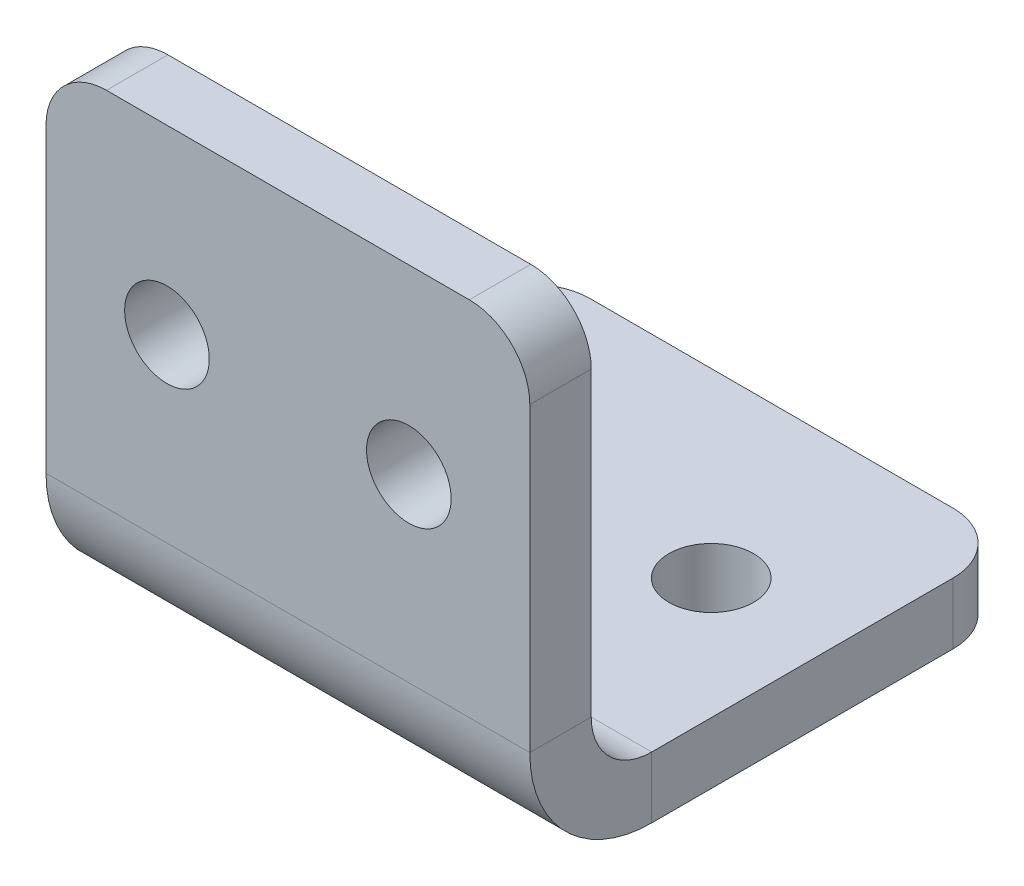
ISO-10303-21;
HEADER;
FILE_DESCRIPTION(('STEP AP214'),'2;1');
FILE_NAME('part.step','',(''),(''),'','','');
FILE_SCHEMA(('AUTOMOTIVE_DESIGN { 1 0 10303 214 1 1 1 1 }'));
ENDSEC;
DATA;
#1=APPLICATION_CONTEXT('core data for automotive mechanical design processes');
#2=APPLICATION_PROTOCOL_DEFINITION('international standard','automotive_design',2000,#1);
#3=PRODUCT_CONTEXT('',#1,'mechanical');
#4=PRODUCT('Part','Part','',(#3));
#5=PRODUCT_RELATED_PRODUCT_CATEGORY('part','',(#4));
#6=PRODUCT_DEFINITION_FORMATION('','',#4);
#7=PRODUCT_DEFINITION_CONTEXT('part definition',#1,'design');
#8=PRODUCT_DEFINITION('design','',#6,#7);
#9=PRODUCT_DEFINITION_SHAPE('','',#8);
#10=(LENGTH_UNIT() NAMED_UNIT(*) SI_UNIT(.MILLI.,.METRE.));
#11=(NAMED_UNIT(*) PLANE_ANGLE_UNIT() SI_UNIT($,.RADIAN.));
#12=(NAMED_UNIT(*) SI_UNIT($,.STERADIAN.) SOLID_ANGLE_UNIT());
#13=UNCERTAINTY_MEASURE_WITH_UNIT(LENGTH_MEASURE(1.E-05),#10,'distance_accuracy_value','');
#14=(GEOMETRIC_REPRESENTATION_CONTEXT(3) GLOBAL_UNCERTAINTY_ASSIGNED_CONTEXT((#13)) GLOBAL_UNIT_ASSIGNED_CONTEXT((#10,
#11,#12)) REPRESENTATION_CONTEXT('',''));
#15=CARTESIAN_POINT('',(0.,0.,0.));
#16=DIRECTION('',(0.,0.,1.));
#17=DIRECTION('',(1.,0.,0.));
#18=AXIS2_PLACEMENT_3D('',#15,#16,#17);
#19=CARTESIAN_POINT('',(40.,0.,0.));
#20=DIRECTION('',(0.,-1.,0.));
#21=DIRECTION('',(0.,0.,-1.));
#22=AXIS2_PLACEMENT_3D('',#19,#20,#21);
#23=PLANE('',#22);
#24=CARTESIAN_POINT('',(10.,0.,-25.00000001));
#25=DIRECTION('',(0.,-1.,0.));
#26=DIRECTION('',(-1.,0.,0.));
#27=AXIS2_PLACEMENT_3D('',#24,#25,#26);
#28=CIRCLE('',#27,3.5);
#29=CARTESIAN_POINT('',(6.5,0.,-25.00000001));
#30=VERTEX_POINT('',#29);
#31=EDGE_CURVE('E330',#30,#30,#28,.F.);
#32=ORIENTED_EDGE('',*,*,#31,.F.);
#33=EDGE_LOOP('',(#32));
#34=FACE_BOUND('',#33,.T.);
#35=DIRECTION('',(0.,0.,1.));
#36=VECTOR('',#35,1.);
#37=CARTESIAN_POINT('',(40.,0.,0.));
#38=LINE('',#37,#36);
#39=CARTESIAN_POINT('',(40.,0.,-35.00000001));
#40=VERTEX_POINT('',#39);
#41=CARTESIAN_POINT('',(40.,0.,-10.08));
#42=VERTEX_POINT('',#41);
#43=EDGE_CURVE('E226',#40,#42,#38,.T.);
#44=ORIENTED_EDGE('',*,*,#43,.F.);
#45=CARTESIAN_POINT('',(35.,0.,-35.00000001));
#46=DIRECTION('',(0.,-1.,0.));
#47=DIRECTION('',(0.,0.,-1.));
#48=AXIS2_PLACEMENT_3D('',#45,#46,#47);
#49=CIRCLE('',#48,5.);
#50=CARTESIAN_POINT('',(35.,0.,-40.00000001));
#51=VERTEX_POINT('',#50);
#52=EDGE_CURVE('E266',#40,#51,#49,.F.);
#53=ORIENTED_EDGE('',*,*,#52,.T.);
#54=DIRECTION('',(-1.,0.,0.));
#55=VECTOR('',#54,1.);
#56=CARTESIAN_POINT('',(40.,0.,-40.00000001));
#57=LINE('',#56,#55);
#58=CARTESIAN_POINT('',(5.,0.,-40.00000001));
#59=VERTEX_POINT('',#58);
#60=EDGE_CURVE('E229',#51,#59,#57,.T.);
#61=ORIENTED_EDGE('',*,*,#60,.T.);
#62=CARTESIAN_POINT('',(5.,0.,-35.00000001));
#63=DIRECTION('',(0.,-1.,0.));
#64=DIRECTION('',(0.,0.,-1.));
#65=AXIS2_PLACEMENT_3D('',#62,#63,#64);
#66=CIRCLE('',#65,5.);
#67=CARTESIAN_POINT('',(0.,0.,-35.00000001));
#68=VERTEX_POINT('',#67);
#69=EDGE_CURVE('E264',#59,#68,#66,.F.);
#70=ORIENTED_EDGE('',*,*,#69,.T.);
#71=DIRECTION('',(0.,0.,1.));
#72=VECTOR('',#71,1.);
#73=CARTESIAN_POINT('',(0.,0.,0.));
#74=LINE('',#73,#72);
#75=CARTESIAN_POINT('',(0.,0.,-10.08));
#76=VERTEX_POINT('',#75);
#77=EDGE_CURVE('E224',#68,#76,#74,.T.);
#78=ORIENTED_EDGE('',*,*,#77,.T.);
#79=DIRECTION('',(1.,0.,0.));
#80=VECTOR('',#79,1.);
#81=CARTESIAN_POINT('',(40.,0.,-10.08));
#82=LINE('',#81,#80);
#83=EDGE_CURVE('E215',#42,#76,#82,.F.);
#84=ORIENTED_EDGE('',*,*,#83,.F.);
#85=EDGE_LOOP('',(#44,#53,#61,#70,#78,#84));
#86=FACE_BOUND('',#85,.T.);
#87=CARTESIAN_POINT('',(30.,0.,-25.00000001));
#88=DIRECTION('',(0.,-1.,0.));
#89=DIRECTION('',(-1.,0.,0.));
#90=AXIS2_PLACEMENT_3D('',#87,#88,#89);
#91=CIRCLE('',#90,3.5);
#92=CARTESIAN_POINT('',(26.5,0.,-25.00000001));
#93=VERTEX_POINT('',#92);
#94=EDGE_CURVE('E241',#93,#93,#91,.T.);
#95=ORIENTED_EDGE('',*,*,#94,.T.);
#96=EDGE_LOOP('',(#95));
#97=FACE_BOUND('',#96,.T.);
#98=ADVANCED_FACE('F63',(#34,#86,#97),#23,.F.);
#99=CARTESIAN_POINT('',(40.,-5.08,0.));
#100=DIRECTION('',(0.,-1.,0.));
#101=DIRECTION('',(0.,0.,-1.));
#102=AXIS2_PLACEMENT_3D('',#99,#100,#101);
#103=PLANE('',#102);
#104=DIRECTION('',(1.,0.,0.));
#105=VECTOR('',#104,1.);
#106=CARTESIAN_POINT('',(40.,-5.08,-40.00000001));
#107=LINE('',#106,#105);
#108=CARTESIAN_POINT('',(35.,-5.08,-40.00000001));
#109=VERTEX_POINT('',#108);
#110=CARTESIAN_POINT('',(5.,-5.08,-40.00000001));
#111=VERTEX_POINT('',#110);
#112=EDGE_CURVE('E227',#109,#111,#107,.F.);
#113=ORIENTED_EDGE('',*,*,#112,.F.);
#114=CARTESIAN_POINT('',(35.,-5.08,-35.00000001));
#115=DIRECTION('',(0.,-1.,0.));
#116=DIRECTION('',(0.,0.,-1.));
#117=AXIS2_PLACEMENT_3D('',#114,#115,#116);
#118=CIRCLE('',#117,5.);
#119=CARTESIAN_POINT('',(40.,-5.08,-35.00000001));
#120=VERTEX_POINT('',#119);
#121=EDGE_CURVE('E71',#109,#120,#118,.T.);
#122=ORIENTED_EDGE('',*,*,#121,.T.);
#123=DIRECTION('',(0.,0.,-1.));
#124=VECTOR('',#123,1.);
#125=CARTESIAN_POINT('',(40.,-5.08,0.));
#126=LINE('',#125,#124);
#127=CARTESIAN_POINT('',(40.,-5.08000000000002,-10.08));
#128=VERTEX_POINT('',#127);
#129=EDGE_CURVE('E234',#120,#128,#126,.F.);
#130=ORIENTED_EDGE('',*,*,#129,.T.);
#131=DIRECTION('',(1.,0.,0.));
#132=VECTOR('',#131,1.);
#133=CARTESIAN_POINT('',(40.,-5.08000000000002,-10.08));
#134=LINE('',#133,#132);
#135=CARTESIAN_POINT('',(0.,-5.08,-10.08));
#136=VERTEX_POINT('',#135);
#137=EDGE_CURVE('E161',#128,#136,#134,.F.);
#138=ORIENTED_EDGE('',*,*,#137,.T.);
#139=DIRECTION('',(0.,0.,-1.));
#140=VECTOR('',#139,1.);
#141=CARTESIAN_POINT('',(0.,-5.08,0.));
#142=LINE('',#141,#140);
#143=CARTESIAN_POINT('',(0.,-5.08,-35.00000001));
#144=VERTEX_POINT('',#143);
#145=EDGE_CURVE('E222',#144,#136,#142,.F.);
#146=ORIENTED_EDGE('',*,*,#145,.F.);
#147=CARTESIAN_POINT('',(5.,-5.08,-35.00000001));
#148=DIRECTION('',(0.,-1.,0.));
#149=DIRECTION('',(0.,0.,-1.));
#150=AXIS2_PLACEMENT_3D('',#147,#148,#149);
#151=CIRCLE('',#150,5.);
#152=EDGE_CURVE('E83',#144,#111,#151,.T.);
#153=ORIENTED_EDGE('',*,*,#152,.T.);
#154=EDGE_LOOP('',(#113,#122,#130,#138,#146,#153));
#155=FACE_BOUND('',#154,.T.);
#156=CARTESIAN_POINT('',(10.,-5.08,-25.00000001));
#157=DIRECTION('',(0.,-1.,0.));
#158=DIRECTION('',(0.,0.,-1.));
#159=AXIS2_PLACEMENT_3D('',#156,#157,#158);
#160=CIRCLE('',#159,3.5);
#161=CARTESIAN_POINT('',(10.,-5.08,-28.50000001));
#162=VERTEX_POINT('',#161);
#163=EDGE_CURVE('E237',#162,#162,#160,.T.);
#164=ORIENTED_EDGE('',*,*,#163,.F.);
#165=EDGE_LOOP('',(#164));
#166=FACE_BOUND('',#165,.T.);
#167=CARTESIAN_POINT('',(30.,-5.08,-25.00000001));
#168=DIRECTION('',(0.,-1.,0.));
#169=DIRECTION('',(0.,0.,-1.));
#170=AXIS2_PLACEMENT_3D('',#167,#168,#169);
#171=CIRCLE('',#170,3.5);
#172=CARTESIAN_POINT('',(30.,-5.08,-28.50000001));
#173=VERTEX_POINT('',#172);
#174=EDGE_CURVE('E240',#173,#173,#171,.F.);
#175=ORIENTED_EDGE('',*,*,#174,.T.);
#176=EDGE_LOOP('',(#175));
#177=FACE_BOUND('',#176,.T.);
#178=ADVANCED_FACE('F275',(#155,#166,#177),#103,.T.);
#179=CARTESIAN_POINT('',(0.,0.,0.));
#180=DIRECTION('',(0.,0.,-1.));
#181=DIRECTION('',(-1.,0.,0.));
#182=AXIS2_PLACEMENT_3D('',#179,#180,#181);
#183=PLANE('',#182);
#184=DIRECTION('',(0.,1.,0.));
#185=VECTOR('',#184,1.);
#186=CARTESIAN_POINT('',(40.,0.,0.));
#187=LINE('',#186,#185);
#188=CARTESIAN_POINT('',(40.,4.99999999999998,0.));
#189=VERTEX_POINT('',#188);
#190=CARTESIAN_POINT('',(40.,29.92000001,0.));
#191=VERTEX_POINT('',#190);
#192=EDGE_CURVE('E183',#189,#191,#187,.T.);
#193=ORIENTED_EDGE('',*,*,#192,.T.);
#194=CARTESIAN_POINT('',(35.,29.92000001,0.));
#195=DIRECTION('',(0.,0.,-1.));
#196=DIRECTION('',(-1.,0.,0.));
#197=AXIS2_PLACEMENT_3D('',#194,#195,#196);
#198=CIRCLE('',#197,5.);
#199=CARTESIAN_POINT('',(35.,34.92000001,0.));
#200=VERTEX_POINT('',#199);
#201=EDGE_CURVE('E256',#191,#200,#198,.F.);
#202=ORIENTED_EDGE('',*,*,#201,.T.);
#203=DIRECTION('',(-1.,0.,0.));
#204=VECTOR('',#203,1.);
#205=CARTESIAN_POINT('',(0.,34.92000001,0.));
#206=LINE('',#205,#204);
#207=CARTESIAN_POINT('',(5.,34.92000001,0.));
#208=VERTEX_POINT('',#207);
#209=EDGE_CURVE('E192',#200,#208,#206,.T.);
#210=ORIENTED_EDGE('',*,*,#209,.T.);
#211=CARTESIAN_POINT('',(5.,29.92000001,0.));
#212=DIRECTION('',(0.,0.,-1.));
#213=DIRECTION('',(-1.,0.,0.));
#214=AXIS2_PLACEMENT_3D('',#211,#212,#213);
#215=CIRCLE('',#214,5.);
#216=CARTESIAN_POINT('',(0.,29.92000001,0.));
#217=VERTEX_POINT('',#216);
#218=EDGE_CURVE('E254',#208,#217,#215,.F.);
#219=ORIENTED_EDGE('',*,*,#218,.T.);
#220=DIRECTION('',(0.,-1.,0.));
#221=VECTOR('',#220,1.);
#222=CARTESIAN_POINT('',(0.,0.,0.));
#223=LINE('',#222,#221);
#224=CARTESIAN_POINT('',(0.,4.99999999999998,0.));
#225=VERTEX_POINT('',#224);
#226=EDGE_CURVE('E186',#217,#225,#223,.T.);
#227=ORIENTED_EDGE('',*,*,#226,.T.);
#228=DIRECTION('',(1.,0.,0.));
#229=VECTOR('',#228,1.);
#230=CARTESIAN_POINT('',(0.,4.99999999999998,0.));
#231=LINE('',#230,#229);
#232=EDGE_CURVE('E158',#189,#225,#231,.F.);
#233=ORIENTED_EDGE('',*,*,#232,.F.);
#234=EDGE_LOOP('',(#193,#202,#210,#219,#227,#233));
#235=FACE_BOUND('',#234,.T.);
#236=CARTESIAN_POINT('',(10.,19.92000001,0.));
#237=DIRECTION('',(0.,0.,-1.));
#238=DIRECTION('',(-1.,0.,0.));
#239=AXIS2_PLACEMENT_3D('',#236,#237,#238);
#240=CIRCLE('',#239,3.5);
#241=CARTESIAN_POINT('',(6.5,19.92000001,0.));
#242=VERTEX_POINT('',#241);
#243=EDGE_CURVE('E322',#242,#242,#240,.F.);
#244=ORIENTED_EDGE('',*,*,#243,.F.);
#245=EDGE_LOOP('',(#244));
#246=FACE_BOUND('',#245,.T.);
#247=CARTESIAN_POINT('',(30.,19.92000001,0.));
#248=DIRECTION('',(0.,0.,-1.));
#249=DIRECTION('',(-1.,0.,0.));
#250=AXIS2_PLACEMENT_3D('',#247,#248,#249);
#251=CIRCLE('',#250,3.5);
#252=CARTESIAN_POINT('',(26.5,19.92000001,0.));
#253=VERTEX_POINT('',#252);
#254=EDGE_CURVE('E208',#253,#253,#251,.T.);
#255=ORIENTED_EDGE('',*,*,#254,.T.);
#256=EDGE_LOOP('',(#255));
#257=FACE_BOUND('',#256,.T.);
#258=ADVANCED_FACE('F181',(#235,#246,#257),#183,.F.);
#259=CARTESIAN_POINT('',(0.,0.,-5.08));
#260=DIRECTION('',(0.,0.,-1.));
#261=DIRECTION('',(-1.,0.,0.));
#262=AXIS2_PLACEMENT_3D('',#259,#260,#261);
#263=PLANE('',#262);
#264=CARTESIAN_POINT('',(10.,19.92000001,-5.08));
#265=DIRECTION('',(0.,0.,-1.));
#266=DIRECTION('',(-1.,0.,0.));
#267=AXIS2_PLACEMENT_3D('',#264,#265,#266);
#268=CIRCLE('',#267,3.5);
#269=CARTESIAN_POINT('',(6.5,19.92000001,-5.08));
#270=VERTEX_POINT('',#269);
#271=EDGE_CURVE('E244',#270,#270,#268,.F.);
#272=ORIENTED_EDGE('',*,*,#271,.T.);
#273=EDGE_LOOP('',(#272));
#274=FACE_BOUND('',#273,.T.);
#275=DIRECTION('',(1.,0.,0.));
#276=VECTOR('',#275,1.);
#277=CARTESIAN_POINT('',(0.,34.92000001,-5.08));
#278=LINE('',#277,#276);
#279=CARTESIAN_POINT('',(35.,34.92000001,-5.08));
#280=VERTEX_POINT('',#279);
#281=CARTESIAN_POINT('',(5.,34.92000001,-5.08));
#282=VERTEX_POINT('',#281);
#283=EDGE_CURVE('E197',#280,#282,#278,.F.);
#284=ORIENTED_EDGE('',*,*,#283,.F.);
#285=CARTESIAN_POINT('',(35.,29.92000001,-5.08));
#286=DIRECTION('',(0.,0.,-1.));
#287=DIRECTION('',(-1.,0.,0.));
#288=AXIS2_PLACEMENT_3D('',#285,#286,#287);
#289=CIRCLE('',#288,5.);
#290=CARTESIAN_POINT('',(40.,29.92000001,-5.08));
#291=VERTEX_POINT('',#290);
#292=EDGE_CURVE('E251',#280,#291,#289,.T.);
#293=ORIENTED_EDGE('',*,*,#292,.T.);
#294=DIRECTION('',(0.,-1.,0.));
#295=VECTOR('',#294,1.);
#296=CARTESIAN_POINT('',(40.,34.92000001,-5.08));
#297=LINE('',#296,#295);
#298=CARTESIAN_POINT('',(40.,4.99999999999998,-5.08));
#299=VERTEX_POINT('',#298);
#300=EDGE_CURVE('E187',#299,#291,#297,.F.);
#301=ORIENTED_EDGE('',*,*,#300,.F.);
#302=DIRECTION('',(1.,0.,0.));
#303=VECTOR('',#302,1.);
#304=CARTESIAN_POINT('',(0.,4.99999999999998,-5.08));
#305=LINE('',#304,#303);
#306=CARTESIAN_POINT('',(0.,4.99999999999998,-5.08));
#307=VERTEX_POINT('',#306);
#308=EDGE_CURVE('E177',#307,#299,#305,.T.);
#309=ORIENTED_EDGE('',*,*,#308,.F.);
#310=DIRECTION('',(0.,1.,0.));
#311=VECTOR('',#310,1.);
#312=CARTESIAN_POINT('',(0.,0.,-5.08));
#313=LINE('',#312,#311);
#314=CARTESIAN_POINT('',(0.,29.92000001,-5.08));
#315=VERTEX_POINT('',#314);
#316=EDGE_CURVE('E193',#315,#307,#313,.F.);
#317=ORIENTED_EDGE('',*,*,#316,.F.);
#318=CARTESIAN_POINT('',(5.,29.92000001,-5.08));
#319=DIRECTION('',(0.,0.,-1.));
#320=DIRECTION('',(-1.,0.,0.));
#321=AXIS2_PLACEMENT_3D('',#318,#319,#320);
#322=CIRCLE('',#321,5.);
#323=EDGE_CURVE('E249',#315,#282,#322,.T.);
#324=ORIENTED_EDGE('',*,*,#323,.T.);
#325=EDGE_LOOP('',(#284,#293,#301,#309,#317,#324));
#326=FACE_BOUND('',#325,.T.);
#327=CARTESIAN_POINT('',(30.,19.92000001,-5.08));
#328=DIRECTION('',(0.,0.,-1.));
#329=DIRECTION('',(-1.,0.,0.));
#330=AXIS2_PLACEMENT_3D('',#327,#328,#329);
#331=CIRCLE('',#330,3.5);
#332=CARTESIAN_POINT('',(26.5,19.92000001,-5.08));
#333=VERTEX_POINT('',#332);
#334=EDGE_CURVE('E325',#333,#333,#331,.T.);
#335=ORIENTED_EDGE('',*,*,#334,.F.);
#336=EDGE_LOOP('',(#335));
#337=FACE_BOUND('',#336,.T.);
#338=ADVANCED_FACE('F304',(#274,#326,#337),#263,.T.);
#339=CARTESIAN_POINT('',(40.,0.,0.));
#340=DIRECTION('',(1.,0.,0.));
#341=DIRECTION('',(0.,0.,1.));
#342=AXIS2_PLACEMENT_3D('',#339,#340,#341);
#343=PLANE('',#342);
#344=ORIENTED_EDGE('',*,*,#129,.F.);
#345=DIRECTION('',(0.,-1.,0.));
#346=VECTOR('',#345,1.);
#347=CARTESIAN_POINT('',(40.,0.,-35.00000001));
#348=LINE('',#347,#346);
#349=EDGE_CURVE('E261',#120,#40,#348,.F.);
#350=ORIENTED_EDGE('',*,*,#349,.T.);
#351=ORIENTED_EDGE('',*,*,#43,.T.);
#352=DIRECTION('',(0.,-1.,0.));
#353=VECTOR('',#352,1.);
#354=CARTESIAN_POINT('',(40.,0.,-10.08));
#355=LINE('',#354,#353);
#356=EDGE_CURVE('E211',#42,#128,#355,.T.);
#357=ORIENTED_EDGE('',*,*,#356,.T.);
#358=EDGE_LOOP('',(#344,#350,#351,#357));
#359=FACE_BOUND('',#358,.T.);
#360=ADVANCED_FACE('F281',(#359),#343,.T.);
#361=CARTESIAN_POINT('',(40.,0.,-40.00000001));
#362=DIRECTION('',(0.,0.,1.));
#363=DIRECTION('',(-1.,0.,0.));
#364=AXIS2_PLACEMENT_3D('',#361,#362,#363);
#365=PLANE('',#364);
#366=ORIENTED_EDGE('',*,*,#60,.F.);
#367=DIRECTION('',(0.,1.,0.));
#368=VECTOR('',#367,1.);
#369=CARTESIAN_POINT('',(35.,0.,-40.00000001));
#370=LINE('',#369,#368);
#371=EDGE_CURVE('E271',#51,#109,#370,.F.);
#372=ORIENTED_EDGE('',*,*,#371,.T.);
#373=ORIENTED_EDGE('',*,*,#112,.T.);
#374=DIRECTION('',(0.,-1.,0.));
#375=VECTOR('',#374,1.);
#376=CARTESIAN_POINT('',(5.,0.,-40.00000001));
#377=LINE('',#376,#375);
#378=EDGE_CURVE('E268',#111,#59,#377,.F.);
#379=ORIENTED_EDGE('',*,*,#378,.T.);
#380=EDGE_LOOP('',(#366,#372,#373,#379));
#381=FACE_BOUND('',#380,.T.);
#382=ADVANCED_FACE('F289',(#381),#365,.F.);
#383=CARTESIAN_POINT('',(0.,0.,0.));
#384=DIRECTION('',(1.,0.,0.));
#385=DIRECTION('',(0.,0.,1.));
#386=AXIS2_PLACEMENT_3D('',#383,#384,#385);
#387=PLANE('',#386);
#388=ORIENTED_EDGE('',*,*,#77,.F.);
#389=DIRECTION('',(0.,-1.,0.));
#390=VECTOR('',#389,1.);
#391=CARTESIAN_POINT('',(0.,0.,-35.00000001));
#392=LINE('',#391,#390);
#393=EDGE_CURVE('E13',#68,#144,#392,.T.);
#394=ORIENTED_EDGE('',*,*,#393,.T.);
#395=ORIENTED_EDGE('',*,*,#145,.T.);
#396=DIRECTION('',(0.,-1.,0.));
#397=VECTOR('',#396,1.);
#398=CARTESIAN_POINT('',(0.,0.,-10.08));
#399=LINE('',#398,#397);
#400=EDGE_CURVE('E219',#76,#136,#399,.T.);
#401=ORIENTED_EDGE('',*,*,#400,.F.);
#402=EDGE_LOOP('',(#388,#394,#395,#401));
#403=FACE_BOUND('',#402,.T.);
#404=ADVANCED_FACE('F293',(#403),#387,.F.);
#405=CARTESIAN_POINT('',(0.,4.99999999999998,-10.08));
#406=DIRECTION('',(-1.,0.,0.));
#407=DIRECTION('',(0.,0.,1.));
#408=AXIS2_PLACEMENT_3D('',#405,#406,#407);
#409=PLANE('',#408);
#410=DIRECTION('',(0.,0.,-1.));
#411=VECTOR('',#410,1.);
#412=CARTESIAN_POINT('',(0.,4.99999999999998,0.));
#413=LINE('',#412,#411);
#414=EDGE_CURVE('E205',#307,#225,#413,.F.);
#415=ORIENTED_EDGE('',*,*,#414,.F.);
#416=CARTESIAN_POINT('',(0.,4.99999999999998,-10.08));
#417=DIRECTION('',(1.,0.,0.));
#418=DIRECTION('',(0.,0.,-1.));
#419=AXIS2_PLACEMENT_3D('',#416,#417,#418);
#420=CIRCLE('',#419,5.);
#421=EDGE_CURVE('E165',#76,#307,#420,.F.);
#422=ORIENTED_EDGE('',*,*,#421,.F.);
#423=ORIENTED_EDGE('',*,*,#400,.T.);
#424=CARTESIAN_POINT('',(0.,4.99999999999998,-10.08));
#425=DIRECTION('',(1.,0.,0.));
#426=DIRECTION('',(0.,0.,-1.));
#427=AXIS2_PLACEMENT_3D('',#424,#425,#426);
#428=CIRCLE('',#427,10.08);
#429=EDGE_CURVE('E210',#136,#225,#428,.F.);
#430=ORIENTED_EDGE('',*,*,#429,.T.);
#431=EDGE_LOOP('',(#415,#422,#423,#430));
#432=FACE_BOUND('',#431,.T.);
#433=ADVANCED_FACE('F297',(#432),#409,.T.);
#434=CARTESIAN_POINT('',(40.,4.99999999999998,-10.08));
#435=DIRECTION('',(-1.,0.,0.));
#436=DIRECTION('',(0.,0.,1.));
#437=AXIS2_PLACEMENT_3D('',#434,#435,#436);
#438=PLANE('',#437);
#439=CARTESIAN_POINT('',(40.,4.99999999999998,-10.08));
#440=DIRECTION('',(1.,0.,0.));
#441=DIRECTION('',(0.,0.,-1.));
#442=AXIS2_PLACEMENT_3D('',#439,#440,#441);
#443=CIRCLE('',#442,5.);
#444=EDGE_CURVE('E172',#299,#42,#443,.T.);
#445=ORIENTED_EDGE('',*,*,#444,.F.);
#446=DIRECTION('',(0.,0.,-1.));
#447=VECTOR('',#446,1.);
#448=CARTESIAN_POINT('',(40.,4.99999999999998,-5.07999999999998));
#449=LINE('',#448,#447);
#450=EDGE_CURVE('E169',#299,#189,#449,.F.);
#451=ORIENTED_EDGE('',*,*,#450,.T.);
#452=CARTESIAN_POINT('',(40.,4.99999999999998,-10.08));
#453=DIRECTION('',(1.,0.,0.));
#454=DIRECTION('',(0.,0.,-1.));
#455=AXIS2_PLACEMENT_3D('',#452,#453,#454);
#456=CIRCLE('',#455,10.08);
#457=EDGE_CURVE('E153',#189,#128,#456,.T.);
#458=ORIENTED_EDGE('',*,*,#457,.T.);
#459=ORIENTED_EDGE('',*,*,#356,.F.);
#460=EDGE_LOOP('',(#445,#451,#458,#459));
#461=FACE_BOUND('',#460,.T.);
#462=ADVANCED_FACE('F170',(#461),#438,.F.);
#463=CARTESIAN_POINT('',(40.,4.99999999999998,-10.08));
#464=DIRECTION('',(1.,0.,0.));
#465=DIRECTION('',(0.,0.,1.));
#466=AXIS2_PLACEMENT_3D('',#463,#464,#465);
#467=CYLINDRICAL_SURFACE('',#466,10.08);
#468=ORIENTED_EDGE('',*,*,#137,.F.);
#469=ORIENTED_EDGE('',*,*,#457,.F.);
#470=ORIENTED_EDGE('',*,*,#232,.T.);
#471=ORIENTED_EDGE('',*,*,#429,.F.);
#472=EDGE_LOOP('',(#468,#469,#470,#471));
#473=FACE_BOUND('',#472,.T.);
#474=ADVANCED_FACE('F155',(#473),#467,.T.);
#475=CARTESIAN_POINT('',(40.,4.99999999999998,-10.08));
#476=DIRECTION('',(1.,0.,0.));
#477=DIRECTION('',(0.,0.,1.));
#478=AXIS2_PLACEMENT_3D('',#475,#476,#477);
#479=CYLINDRICAL_SURFACE('',#478,5.);
#480=ORIENTED_EDGE('',*,*,#83,.T.);
#481=ORIENTED_EDGE('',*,*,#421,.T.);
#482=ORIENTED_EDGE('',*,*,#308,.T.);
#483=ORIENTED_EDGE('',*,*,#444,.T.);
#484=EDGE_LOOP('',(#480,#481,#482,#483));
#485=FACE_BOUND('',#484,.T.);
#486=ADVANCED_FACE('F300',(#485),#479,.F.);
#487=CARTESIAN_POINT('',(40.,34.92000001,0.));
#488=DIRECTION('',(-1.,0.,0.));
#489=DIRECTION('',(0.,-1.,0.));
#490=AXIS2_PLACEMENT_3D('',#487,#488,#489);
#491=PLANE('',#490);
#492=ORIENTED_EDGE('',*,*,#300,.T.);
#493=DIRECTION('',(0.,0.,-1.));
#494=VECTOR('',#493,1.);
#495=CARTESIAN_POINT('',(40.,29.92000001,0.));
#496=LINE('',#495,#494);
#497=EDGE_CURVE('E191',#291,#191,#496,.F.);
#498=ORIENTED_EDGE('',*,*,#497,.T.);
#499=ORIENTED_EDGE('',*,*,#192,.F.);
#500=ORIENTED_EDGE('',*,*,#450,.F.);
#501=EDGE_LOOP('',(#492,#498,#499,#500));
#502=FACE_BOUND('',#501,.T.);
#503=ADVANCED_FACE('F189',(#502),#491,.F.);
#504=CARTESIAN_POINT('',(0.,0.,0.));
#505=DIRECTION('',(1.,0.,0.));
#506=DIRECTION('',(0.,0.,-1.));
#507=AXIS2_PLACEMENT_3D('',#504,#505,#506);
#508=PLANE('',#507);
#509=ORIENTED_EDGE('',*,*,#226,.F.);
#510=DIRECTION('',(0.,0.,-1.));
#511=VECTOR('',#510,1.);
#512=CARTESIAN_POINT('',(0.,29.92000001,0.));
#513=LINE('',#512,#511);
#514=EDGE_CURVE('E258',#217,#315,#513,.T.);
#515=ORIENTED_EDGE('',*,*,#514,.T.);
#516=ORIENTED_EDGE('',*,*,#316,.T.);
#517=ORIENTED_EDGE('',*,*,#414,.T.);
#518=EDGE_LOOP('',(#509,#515,#516,#517));
#519=FACE_BOUND('',#518,.T.);
#520=ADVANCED_FACE('F318',(#519),#508,.F.);
#521=CARTESIAN_POINT('',(0.,34.92000001,0.));
#522=DIRECTION('',(0.,-1.,0.));
#523=DIRECTION('',(0.,0.,-1.));
#524=AXIS2_PLACEMENT_3D('',#521,#522,#523);
#525=PLANE('',#524);
#526=ORIENTED_EDGE('',*,*,#209,.F.);
#527=DIRECTION('',(0.,0.,-1.));
#528=VECTOR('',#527,1.);
#529=CARTESIAN_POINT('',(35.,34.92000001,0.));
#530=LINE('',#529,#528);
#531=EDGE_CURVE('E246',#200,#280,#530,.T.);
#532=ORIENTED_EDGE('',*,*,#531,.T.);
#533=ORIENTED_EDGE('',*,*,#283,.T.);
#534=DIRECTION('',(0.,0.,-1.));
#535=VECTOR('',#534,1.);
#536=CARTESIAN_POINT('',(5.,34.92000001,0.));
#537=LINE('',#536,#535);
#538=EDGE_CURVE('E232',#282,#208,#537,.F.);
#539=ORIENTED_EDGE('',*,*,#538,.T.);
#540=EDGE_LOOP('',(#526,#532,#533,#539));
#541=FACE_BOUND('',#540,.T.);
#542=ADVANCED_FACE('F312',(#541),#525,.F.);
#543=CARTESIAN_POINT('',(10.,19.92000001,45.72));
#544=DIRECTION('',(0.,0.,-1.));
#545=DIRECTION('',(-1.,0.,0.));
#546=AXIS2_PLACEMENT_3D('',#543,#544,#545);
#547=CYLINDRICAL_SURFACE('',#546,3.5);
#548=ORIENTED_EDGE('',*,*,#271,.F.);
#549=EDGE_LOOP('',(#548));
#550=FACE_BOUND('',#549,.T.);
#551=ORIENTED_EDGE('',*,*,#243,.T.);
#552=EDGE_LOOP('',(#551));
#553=FACE_BOUND('',#552,.T.);
#554=ADVANCED_FACE('F427',(#550,#553),#547,.F.);
#555=CARTESIAN_POINT('',(30.,19.92000001,45.72));
#556=DIRECTION('',(0.,0.,-1.));
#557=DIRECTION('',(-1.,0.,0.));
#558=AXIS2_PLACEMENT_3D('',#555,#556,#557);
#559=CYLINDRICAL_SURFACE('',#558,3.5);
#560=ORIENTED_EDGE('',*,*,#334,.T.);
#561=EDGE_LOOP('',(#560));
#562=FACE_BOUND('',#561,.T.);
#563=ORIENTED_EDGE('',*,*,#254,.F.);
#564=EDGE_LOOP('',(#563));
#565=FACE_BOUND('',#564,.T.);
#566=ADVANCED_FACE('F347',(#562,#565),#559,.F.);
#567=CARTESIAN_POINT('',(10.,-50.8,-25.00000001));
#568=DIRECTION('',(0.,1.,0.));
#569=DIRECTION('',(0.,0.,1.));
#570=AXIS2_PLACEMENT_3D('',#567,#568,#569);
#571=CYLINDRICAL_SURFACE('',#570,3.5);
#572=ORIENTED_EDGE('',*,*,#163,.T.);
#573=EDGE_LOOP('',(#572));
#574=FACE_BOUND('',#573,.T.);
#575=ORIENTED_EDGE('',*,*,#31,.T.);
#576=EDGE_LOOP('',(#575));
#577=FACE_BOUND('',#576,.T.);
#578=ADVANCED_FACE('F338',(#574,#577),#571,.F.);
#579=CARTESIAN_POINT('',(30.,-50.8,-25.00000001));
#580=DIRECTION('',(0.,1.,0.));
#581=DIRECTION('',(0.,0.,1.));
#582=AXIS2_PLACEMENT_3D('',#579,#580,#581);
#583=CYLINDRICAL_SURFACE('',#582,3.5);
#584=ORIENTED_EDGE('',*,*,#174,.F.);
#585=EDGE_LOOP('',(#584));
#586=FACE_BOUND('',#585,.T.);
#587=ORIENTED_EDGE('',*,*,#94,.F.);
#588=EDGE_LOOP('',(#587));
#589=FACE_BOUND('',#588,.T.);
#590=ADVANCED_FACE('F336',(#586,#589),#583,.F.);
#591=CARTESIAN_POINT('',(35.,29.92000001,0.));
#592=DIRECTION('',(0.,0.,-1.));
#593=DIRECTION('',(-1.,0.,0.));
#594=AXIS2_PLACEMENT_3D('',#591,#592,#593);
#595=CYLINDRICAL_SURFACE('',#594,5.);
#596=ORIENTED_EDGE('',*,*,#201,.F.);
#597=ORIENTED_EDGE('',*,*,#497,.F.);
#598=ORIENTED_EDGE('',*,*,#292,.F.);
#599=ORIENTED_EDGE('',*,*,#531,.F.);
#600=EDGE_LOOP('',(#596,#597,#598,#599));
#601=FACE_BOUND('',#600,.T.);
#602=ADVANCED_FACE('F307',(#601),#595,.T.);
#603=CARTESIAN_POINT('',(5.,29.92000001,0.));
#604=DIRECTION('',(0.,0.,-1.));
#605=DIRECTION('',(-1.,0.,0.));
#606=AXIS2_PLACEMENT_3D('',#603,#604,#605);
#607=CYLINDRICAL_SURFACE('',#606,5.);
#608=ORIENTED_EDGE('',*,*,#218,.F.);
#609=ORIENTED_EDGE('',*,*,#538,.F.);
#610=ORIENTED_EDGE('',*,*,#323,.F.);
#611=ORIENTED_EDGE('',*,*,#514,.F.);
#612=EDGE_LOOP('',(#608,#609,#610,#611));
#613=FACE_BOUND('',#612,.T.);
#614=ADVANCED_FACE('F315',(#613),#607,.T.);
#615=CARTESIAN_POINT('',(35.,0.,-35.00000001));
#616=DIRECTION('',(0.,-1.,0.));
#617=DIRECTION('',(0.,0.,-1.));
#618=AXIS2_PLACEMENT_3D('',#615,#616,#617);
#619=CYLINDRICAL_SURFACE('',#618,5.);
#620=ORIENTED_EDGE('',*,*,#121,.F.);
#621=ORIENTED_EDGE('',*,*,#371,.F.);
#622=ORIENTED_EDGE('',*,*,#52,.F.);
#623=ORIENTED_EDGE('',*,*,#349,.F.);
#624=EDGE_LOOP('',(#620,#621,#622,#623));
#625=FACE_BOUND('',#624,.T.);
#626=ADVANCED_FACE('F283',(#625),#619,.T.);
#627=CARTESIAN_POINT('',(5.,0.,-35.00000001));
#628=DIRECTION('',(0.,1.,0.));
#629=DIRECTION('',(0.,0.,1.));
#630=AXIS2_PLACEMENT_3D('',#627,#628,#629);
#631=CYLINDRICAL_SURFACE('',#630,5.);
#632=ORIENTED_EDGE('',*,*,#152,.F.);
#633=ORIENTED_EDGE('',*,*,#393,.F.);
#634=ORIENTED_EDGE('',*,*,#69,.F.);
#635=ORIENTED_EDGE('',*,*,#378,.F.);
#636=EDGE_LOOP('',(#632,#633,#634,#635));
#637=FACE_BOUND('',#636,.T.);
#638=ADVANCED_FACE('F65',(#637),#631,.T.);
#639=CLOSED_SHELL('',(#98,#178,#258,#338,#360,#382,#404,#433,#462,#474,#486,#503,#520,#542,#554,
#566,#578,#590,#602,#614,#626,#638));
#640=MANIFOLD_SOLID_BREP('B2',#639);
#641=ADVANCED_BREP_SHAPE_REPRESENTATION('',(#18,#640),#14);
#642=SHAPE_DEFINITION_REPRESENTATION(#9,#641);
ENDSEC;
END-ISO-10303-21;
